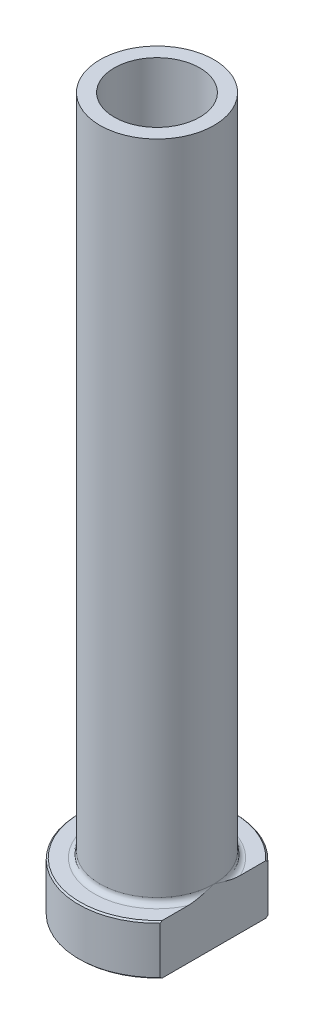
from build123d import *

# Parameters (mm, degrees)
FILLET1_R          = 0.8
CHAMFER1_SIZE      = 0.2
CUT_EXTRUDE1_DEPTH = 102.202766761
CHAMFER2_SIZE      = 0.5


with BuildPart() as part:
    # Sketch1 → Revolve1 (revolve)
    with BuildSketch(Plane.XY, mode=Mode.PRIVATE) as revolve1_sk:
        Polygon((-6, 100), (-8, 100), (-8, 7), (-11, 7), (-11, 0), (-6.25, 0), (-6.25, 33), (-6, 45), align=None)
    revolve(revolve1_sk.sketch.rotate(Axis((0, 92.187680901, 0), (0, -1, 0)), 270), axis=Axis((0, 92.187680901, 0), (0, -1, 0)))

    # Fillet1
    fillet1_edges = [part.edges().sort_by_distance(p)[0] for p in [
        (0, 7, -8),
    ]]
    fillet(fillet1_edges, radius=FILLET1_R)

    # Chamfer1
    chamfer1_edges = [part.edges().sort_by_distance(p)[0] for p in [
        (0, 0, -11),
        (0, 7, -11),
    ]]
    chamfer(chamfer1_edges, length=CHAMFER1_SIZE)

    # Sketch2 → Cut-Extrude1 (cut, through all)
    with BuildSketch(Plane.XZ):
        with BuildLine():
            Line((8, 7.549834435), (8, -7.549834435))
            ThreePointArc((8, -7.549834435), (11, 0), (8, 7.549834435))
        make_face()
    extrude(amount=-CUT_EXTRUDE1_DEPTH, mode=Mode.SUBTRACT)

    # Chamfer2
    chamfer2_edges = [part.edges().sort_by_distance(p)[0] for p in [
        (0, 0, -6.25),
    ]]
    chamfer(chamfer2_edges, length=CHAMFER2_SIZE)


solid = part.part
